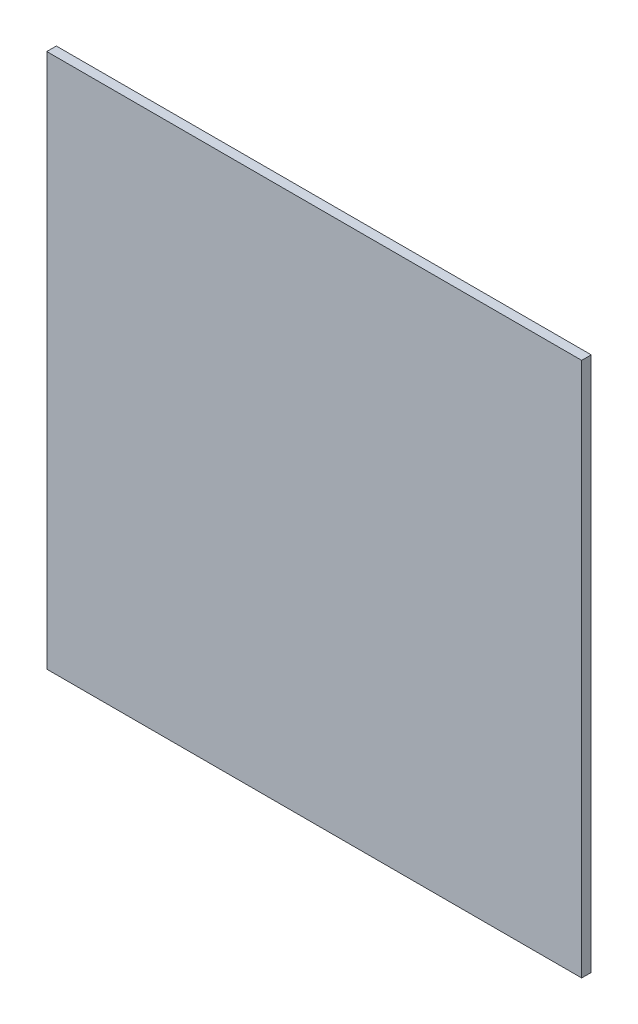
ISO-10303-21;
HEADER;
FILE_DESCRIPTION(('STEP AP214'),'2;1');
FILE_NAME('part.step','',(''),(''),'','','');
FILE_SCHEMA(('AUTOMOTIVE_DESIGN { 1 0 10303 214 1 1 1 1 }'));
ENDSEC;
DATA;
#1=APPLICATION_CONTEXT('core data for automotive mechanical design processes');
#2=APPLICATION_PROTOCOL_DEFINITION('international standard','automotive_design',2000,#1);
#3=PRODUCT_CONTEXT('',#1,'mechanical');
#4=PRODUCT('Part','Part','',(#3));
#5=PRODUCT_RELATED_PRODUCT_CATEGORY('part','',(#4));
#6=PRODUCT_DEFINITION_FORMATION('','',#4);
#7=PRODUCT_DEFINITION_CONTEXT('part definition',#1,'design');
#8=PRODUCT_DEFINITION('design','',#6,#7);
#9=PRODUCT_DEFINITION_SHAPE('','',#8);
#10=(LENGTH_UNIT() NAMED_UNIT(*) SI_UNIT(.MILLI.,.METRE.));
#11=(NAMED_UNIT(*) PLANE_ANGLE_UNIT() SI_UNIT($,.RADIAN.));
#12=(NAMED_UNIT(*) SI_UNIT($,.STERADIAN.) SOLID_ANGLE_UNIT());
#13=UNCERTAINTY_MEASURE_WITH_UNIT(LENGTH_MEASURE(1.E-05),#10,'distance_accuracy_value','');
#14=(GEOMETRIC_REPRESENTATION_CONTEXT(3) GLOBAL_UNCERTAINTY_ASSIGNED_CONTEXT((#13)) GLOBAL_UNIT_ASSIGNED_CONTEXT((#10,
#11,#12)) REPRESENTATION_CONTEXT('',''));
#15=CARTESIAN_POINT('',(0.,0.,0.));
#16=DIRECTION('',(0.,0.,1.));
#17=DIRECTION('',(1.,0.,0.));
#18=AXIS2_PLACEMENT_3D('',#15,#16,#17);
#19=CARTESIAN_POINT('',(0.,0.,19.05));
#20=DIRECTION('',(1.,0.,0.));
#21=DIRECTION('',(0.,0.,-1.));
#22=AXIS2_PLACEMENT_3D('',#19,#20,#21);
#23=PLANE('',#22);
#24=DIRECTION('',(0.,-1.,0.));
#25=VECTOR('',#24,1.);
#26=CARTESIAN_POINT('',(0.,0.,0.));
#27=LINE('',#26,#25);
#28=CARTESIAN_POINT('',(0.,1066.8,0.));
#29=VERTEX_POINT('',#28);
#30=CARTESIAN_POINT('',(0.,0.,0.));
#31=VERTEX_POINT('',#30);
#32=EDGE_CURVE('E70',#29,#31,#27,.T.);
#33=ORIENTED_EDGE('',*,*,#32,.T.);
#34=DIRECTION('',(0.,0.,-1.));
#35=VECTOR('',#34,1.);
#36=CARTESIAN_POINT('',(0.,0.,19.05));
#37=LINE('',#36,#35);
#38=CARTESIAN_POINT('',(0.,0.,19.05));
#39=VERTEX_POINT('',#38);
#40=EDGE_CURVE('E11',#39,#31,#37,.T.);
#41=ORIENTED_EDGE('',*,*,#40,.F.);
#42=DIRECTION('',(0.,-1.,0.));
#43=VECTOR('',#42,1.);
#44=CARTESIAN_POINT('',(0.,0.,19.05));
#45=LINE('',#44,#43);
#46=CARTESIAN_POINT('',(0.,1066.8,19.05));
#47=VERTEX_POINT('',#46);
#48=EDGE_CURVE('E88',#47,#39,#45,.T.);
#49=ORIENTED_EDGE('',*,*,#48,.F.);
#50=DIRECTION('',(0.,0.,-1.));
#51=VECTOR('',#50,1.);
#52=CARTESIAN_POINT('',(0.,1066.8,19.05));
#53=LINE('',#52,#51);
#54=EDGE_CURVE('E82',#47,#29,#53,.T.);
#55=ORIENTED_EDGE('',*,*,#54,.T.);
#56=EDGE_LOOP('',(#33,#41,#49,#55));
#57=FACE_BOUND('',#56,.T.);
#58=ADVANCED_FACE('F26',(#57),#23,.F.);
#59=CARTESIAN_POINT('',(0.,0.,19.05));
#60=DIRECTION('',(0.,1.,0.));
#61=DIRECTION('',(0.,0.,1.));
#62=AXIS2_PLACEMENT_3D('',#59,#60,#61);
#63=PLANE('',#62);
#64=DIRECTION('',(1.,0.,0.));
#65=VECTOR('',#64,1.);
#66=CARTESIAN_POINT('',(0.,0.,0.));
#67=LINE('',#66,#65);
#68=CARTESIAN_POINT('',(1066.8,0.,0.));
#69=VERTEX_POINT('',#68);
#70=EDGE_CURVE('E66',#31,#69,#67,.T.);
#71=ORIENTED_EDGE('',*,*,#70,.T.);
#72=DIRECTION('',(0.,0.,-1.));
#73=VECTOR('',#72,1.);
#74=CARTESIAN_POINT('',(1066.8,0.,19.05));
#75=LINE('',#74,#73);
#76=CARTESIAN_POINT('',(1066.8,0.,19.05));
#77=VERTEX_POINT('',#76);
#78=EDGE_CURVE('E33',#77,#69,#75,.T.);
#79=ORIENTED_EDGE('',*,*,#78,.F.);
#80=DIRECTION('',(1.,0.,0.));
#81=VECTOR('',#80,1.);
#82=CARTESIAN_POINT('',(0.,0.,19.05));
#83=LINE('',#82,#81);
#84=EDGE_CURVE('E78',#39,#77,#83,.T.);
#85=ORIENTED_EDGE('',*,*,#84,.F.);
#86=ORIENTED_EDGE('',*,*,#40,.T.);
#87=EDGE_LOOP('',(#71,#79,#85,#86));
#88=FACE_BOUND('',#87,.T.);
#89=ADVANCED_FACE('F77',(#88),#63,.F.);
#90=CARTESIAN_POINT('',(1066.8,0.,19.05));
#91=DIRECTION('',(-1.,0.,0.));
#92=DIRECTION('',(0.,0.,1.));
#93=AXIS2_PLACEMENT_3D('',#90,#91,#92);
#94=PLANE('',#93);
#95=DIRECTION('',(0.,1.,0.));
#96=VECTOR('',#95,1.);
#97=CARTESIAN_POINT('',(1066.8,0.,0.));
#98=LINE('',#97,#96);
#99=CARTESIAN_POINT('',(1066.8,1066.8,0.));
#100=VERTEX_POINT('',#99);
#101=EDGE_CURVE('E71',#69,#100,#98,.T.);
#102=ORIENTED_EDGE('',*,*,#101,.T.);
#103=DIRECTION('',(0.,0.,-1.));
#104=VECTOR('',#103,1.);
#105=CARTESIAN_POINT('',(1066.8,1066.8,19.05));
#106=LINE('',#105,#104);
#107=CARTESIAN_POINT('',(1066.8,1066.8,19.05));
#108=VERTEX_POINT('',#107);
#109=EDGE_CURVE('E94',#108,#100,#106,.T.);
#110=ORIENTED_EDGE('',*,*,#109,.F.);
#111=DIRECTION('',(0.,1.,0.));
#112=VECTOR('',#111,1.);
#113=CARTESIAN_POINT('',(1066.8,0.,19.05));
#114=LINE('',#113,#112);
#115=EDGE_CURVE('E45',#77,#108,#114,.T.);
#116=ORIENTED_EDGE('',*,*,#115,.F.);
#117=ORIENTED_EDGE('',*,*,#78,.T.);
#118=EDGE_LOOP('',(#102,#110,#116,#117));
#119=FACE_BOUND('',#118,.T.);
#120=ADVANCED_FACE('F97',(#119),#94,.F.);
#121=CARTESIAN_POINT('',(0.,1066.8,19.05));
#122=DIRECTION('',(0.,-1.,0.));
#123=DIRECTION('',(0.,0.,-1.));
#124=AXIS2_PLACEMENT_3D('',#121,#122,#123);
#125=PLANE('',#124);
#126=DIRECTION('',(-1.,0.,0.));
#127=VECTOR('',#126,1.);
#128=CARTESIAN_POINT('',(0.,1066.8,0.));
#129=LINE('',#128,#127);
#130=EDGE_CURVE('E86',#100,#29,#129,.T.);
#131=ORIENTED_EDGE('',*,*,#130,.T.);
#132=ORIENTED_EDGE('',*,*,#54,.F.);
#133=DIRECTION('',(-1.,0.,0.));
#134=VECTOR('',#133,1.);
#135=CARTESIAN_POINT('',(0.,1066.8,19.05));
#136=LINE('',#135,#134);
#137=EDGE_CURVE('E40',#108,#47,#136,.T.);
#138=ORIENTED_EDGE('',*,*,#137,.F.);
#139=ORIENTED_EDGE('',*,*,#109,.T.);
#140=EDGE_LOOP('',(#131,#132,#138,#139));
#141=FACE_BOUND('',#140,.T.);
#142=ADVANCED_FACE('F99',(#141),#125,.F.);
#143=CARTESIAN_POINT('',(0.,1066.8,19.05));
#144=DIRECTION('',(0.,0.,-1.));
#145=DIRECTION('',(-1.,0.,0.));
#146=AXIS2_PLACEMENT_3D('',#143,#144,#145);
#147=PLANE('',#146);
#148=ORIENTED_EDGE('',*,*,#48,.T.);
#149=ORIENTED_EDGE('',*,*,#84,.T.);
#150=ORIENTED_EDGE('',*,*,#115,.T.);
#151=ORIENTED_EDGE('',*,*,#137,.T.);
#152=EDGE_LOOP('',(#148,#149,#150,#151));
#153=FACE_BOUND('',#152,.T.);
#154=ADVANCED_FACE('F100',(#153),#147,.F.);
#155=CARTESIAN_POINT('',(0.,1066.8,0.));
#156=DIRECTION('',(0.,0.,-1.));
#157=DIRECTION('',(-1.,0.,0.));
#158=AXIS2_PLACEMENT_3D('',#155,#156,#157);
#159=PLANE('',#158);
#160=ORIENTED_EDGE('',*,*,#32,.F.);
#161=ORIENTED_EDGE('',*,*,#130,.F.);
#162=ORIENTED_EDGE('',*,*,#101,.F.);
#163=ORIENTED_EDGE('',*,*,#70,.F.);
#164=EDGE_LOOP('',(#160,#161,#162,#163));
#165=FACE_BOUND('',#164,.T.);
#166=ADVANCED_FACE('F67',(#165),#159,.T.);
#167=CLOSED_SHELL('',(#58,#89,#120,#142,#154,#166));
#168=MANIFOLD_SOLID_BREP('B2',#167);
#169=ADVANCED_BREP_SHAPE_REPRESENTATION('',(#18,#168),#14);
#170=SHAPE_DEFINITION_REPRESENTATION(#9,#169);
ENDSEC;
END-ISO-10303-21;
